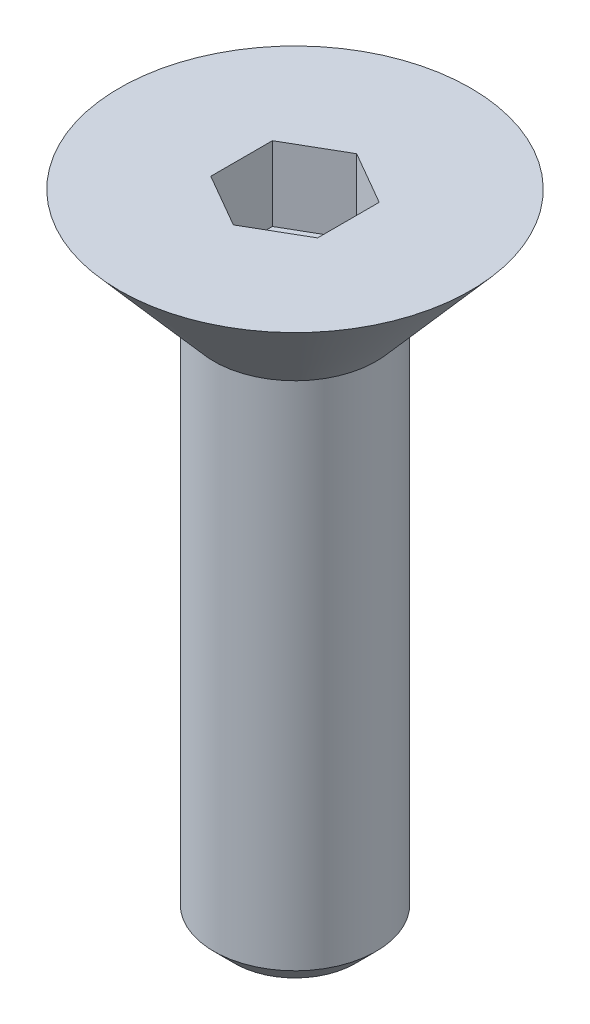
from build123d import *

# Parameters (mm, degrees)
CUT_EXTRUDE1_DEPTH = 2.2098


with BuildPart() as part:
    # Sketch1 → Base-Revolve (revolve)
    with BuildSketch(Plane.XY, mode=Mode.PRIVATE) as base_revolve_sk:
        Polygon((0, 0), (2.413, 0), (5.2197, 3.2258), (0, 3.2258), align=None)
    revolve(base_revolve_sk.sketch.rotate(Axis((0, 0, 0), (0, 1, 0)), 90), axis=Axis((0, 0, 0), (0, 1, 0)))

    # Sketch2 → Boss-Revolve1 (revolve)
    with BuildSketch(Plane.XY, mode=Mode.PRIVATE) as boss_revolve1_sk:
        Polygon((0, -15.8242), (1.78308, -15.8242), (2.413, -15.19428), (2.413, 0), (0, 0), align=None)
    revolve(boss_revolve1_sk.sketch.rotate(Axis((0, 0, 0), (0, 1, 0)), 90), axis=Axis((0, 0, 0), (0, 1, 0)))

    # Sketch3 → Cut-Extrude1 (cut)
    with BuildSketch(Plane(origin=(0, 3.2258, 0), x_dir=(-1, 0, 0), z_dir=(0, 1, 0))):
        Polygon((1.5875, 0.916543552), (0, 1.833087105), (-1.5875, 0.916543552), (-1.5875, -0.916543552), (0, -1.833087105), (1.5875, -0.916543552), align=None)
    extrude(amount=-CUT_EXTRUDE1_DEPTH, mode=Mode.SUBTRACT)


solid = part.part
